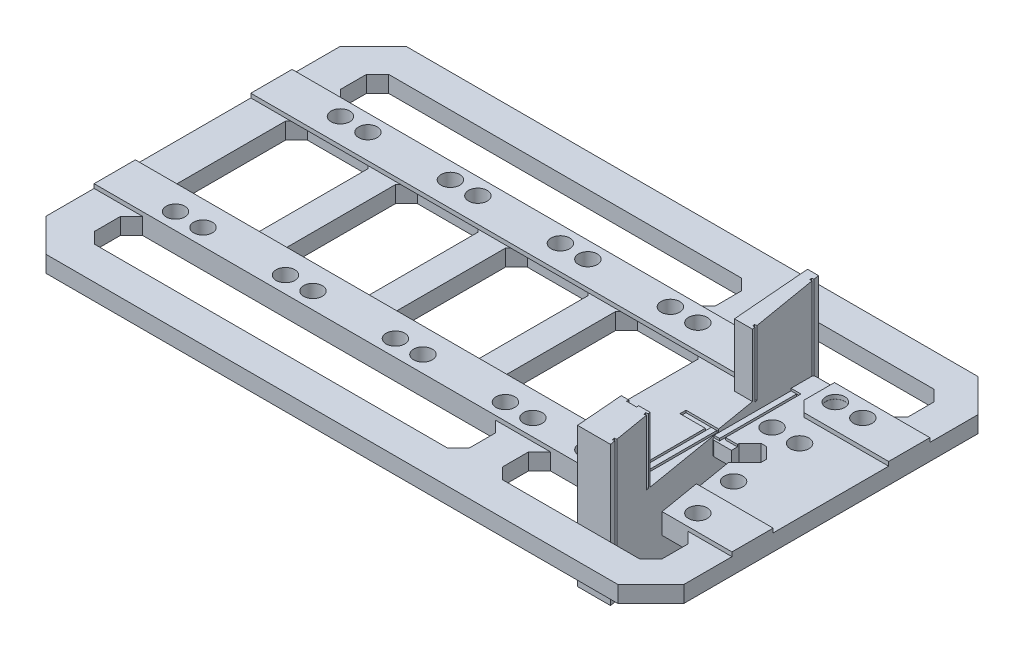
from build123d import *

# Parameters (mm, degrees)
SKETCH1_R           = 1.7
BOSS_EXTRUDE1_DEPTH = 3
SKETCH2_W           = 1
SKETCH2_H           = 14
CUT_EXTRUDE1_DEPTH  = 0.4
BOSS_EXTRUDE2_DEPTH = 11
BOSS_EXTRUDE3_DEPTH = 11.4
SKETCH9_W           = 0.4
SKETCH9_H           = 25.4
SKETCH9_H_2         = 12.2
CUT_EXTRUDE5_DEPTH  = 0.4
SKETCH10_W          = 1.8
SKETCH10_H          = 11.8
CUT_EXTRUDE6_DEPTH  = 0.4
SKETCH11_R          = 1.711275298
SKETCH11_R_2        = 1.7
BOSS_EXTRUDE4_DEPTH = 0.75


with BuildPart() as part:
    # Sketch1 → Boss-Extrude1 (new body)
    with BuildSketch(Plane(origin=(0, 0, 0), x_dir=(1, 0, 0), z_dir=(0, 1, 0))):
        Polygon((57, -32.75), (-47, -32.75), (-53, -26.75), (-53, 26.75), (-47, 32.75), (57, 32.75), (63, 26.75), (63, -26.75), align=None)
        with Locations(Location((51.3, -6, 0), (0, 0, 90))):
            Circle(SKETCH1_R, mode=Mode.SUBTRACT)
        with Locations(Location((51.3, 6, 0), (0, 0, 270))):
            Circle(SKETCH1_R, mode=Mode.SUBTRACT)
        with Locations(Location((33.8, -15, 0), (0, 0, 270))):
            Circle(SKETCH1_R, mode=Mode.SUBTRACT)
        with Locations(Location((46.3, 6, 0), (0, 0, 270))):
            Circle(SKETCH1_R, mode=Mode.SUBTRACT)
        with Locations(Location((23.8, 14.999999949, 0), (0, 0, 270))):
            Circle(SKETCH1_R, mode=Mode.SUBTRACT)
        with Locations(Location((18.8, 14.999999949, 0), (0, 0, 270))):
            Circle(SKETCH1_R, mode=Mode.SUBTRACT)
        with Locations(Location((3.8, 14.999999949, 0), (0, 0, 270))):
            Circle(SKETCH1_R, mode=Mode.SUBTRACT)
        with Locations(Location((-1.2, 14.999999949, 0), (0, 0, 270))):
            Circle(SKETCH1_R, mode=Mode.SUBTRACT)
        with Locations(Location((-16.2, 14.999999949, 0), (0, 0, 270))):
            Circle(SKETCH1_R, mode=Mode.SUBTRACT)
        with Locations(Location((-21.2, 14.999999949, 0), (0, 0, 270))):
            Circle(SKETCH1_R, mode=Mode.SUBTRACT)
        with Locations(Location((48.8, 15, 0), (0, 0, 270))):
            Circle(SKETCH1_R, mode=Mode.SUBTRACT)
        with Locations(Location((-36.2, 14.999999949, 0), (0, 0, 270))):
            Circle(SKETCH1_R, mode=Mode.SUBTRACT)
        with Locations(Location((-41.2, 14.999999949, 0), (0, 0, 270))):
            Circle(SKETCH1_R, mode=Mode.SUBTRACT)
        with Locations(Location((53.8, -15, 0), (0, 0, 90))):
            Circle(SKETCH1_R, mode=Mode.SUBTRACT)
        with Locations(Location((-41.2, -15, 0), (0, 0, 90))):
            Circle(SKETCH1_R, mode=Mode.SUBTRACT)
        with Locations(Location((-36.2, -15, 0), (0, 0, 90))):
            Circle(SKETCH1_R, mode=Mode.SUBTRACT)
        with Locations(Location((-21.2, -15, 0), (0, 0, 90))):
            Circle(SKETCH1_R, mode=Mode.SUBTRACT)
        with Locations(Location((53.8, 15, 0), (0, 0, 270))):
            Circle(SKETCH1_R, mode=Mode.SUBTRACT)
        with Locations(Location((-16.2, -15, 0), (0, 0, 90))):
            Circle(SKETCH1_R, mode=Mode.SUBTRACT)
        with Locations(Location((-1.2, -15, 0), (0, 0, 90))):
            Circle(SKETCH1_R, mode=Mode.SUBTRACT)
        with Locations(Location((3.8, -15, 0), (0, 0, 90))):
            Circle(SKETCH1_R, mode=Mode.SUBTRACT)
        with Locations(Location((18.8, -15, 0), (0, 0, 90))):
            Circle(SKETCH1_R, mode=Mode.SUBTRACT)
        with Locations(Location((23.8, -15, 0), (0, 0, 90))):
            Circle(SKETCH1_R, mode=Mode.SUBTRACT)
        with Locations(Location((33.8, 15, 0), (0, 0, 270))):
            Circle(SKETCH1_R, mode=Mode.SUBTRACT)
        Polygon((13.800005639, 9.999999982), (13.800005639, -10.000000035), (15.800005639, -12.000000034), (26.800005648, -12.000000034), (28.800005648, -10.000000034), (28.800005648, 9.999999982), (26.800005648, 11.999999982), (15.80000564, 11.999999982), align=None, mode=Mode.SUBTRACT)
        Polygon((-44.2, 17.999999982), (-46.2, 19.999999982), (-46.2, 24.75), (-44.2, 26.75), (20.000000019, 26.75), (22.000000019, 24.75), (22.000000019, 19.999999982), (20.000000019, 17.999999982), align=None, mode=Mode.SUBTRACT)
        with BuildLine():
            Line((42.25, 17.999999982), (55, 17.999999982))
            Line((55, 17.999999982), (57, 19.999999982))
            Line((57, 19.999999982), (57, 24.749999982))
            Line((57, 24.749999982), (55, 26.749999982))
            Line((55, 26.749999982), (30.000000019, 26.749999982))
            Line((30.000000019, 26.749999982), (28.000000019, 24.749999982))
            Line((28.000000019, 24.749999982), (28.000000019, 19.999999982))
            Line((28.000000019, 19.999999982), (30.000000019, 17.999999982))
            Line((30.000000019, 17.999999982), (34.383003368, 17.999999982))
            Line((34.383003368, 17.999999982), (36.222260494, 19.993529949))
            Line((36.222260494, 19.993529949), (36.000000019, 22.749999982))
            Line((36.000000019, 22.749999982), (38.000000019, 22.749999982))
            Line((38.000000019, 22.749999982), (45.668539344, -22.750000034))
            Line((45.668539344, -22.750000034), (39.66876894, -22.750000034))
            Line((39.66876894, -22.750000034), (39.446508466, -19.99353))
            Line((39.446508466, -19.99353), (37.285765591, -18.000000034))
            Line((37.285765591, -18.000000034), (30.000000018, -18.000000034))
            Line((30.000000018, -18.000000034), (28.000000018, -20.000000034))
            Line((28.000000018, -20.000000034), (28.000000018, -24.750000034))
            Line((28.000000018, -24.750000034), (30.000000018, -26.750000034))
            Line((30.000000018, -26.750000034), (55, -26.750000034))
            Line((55, -26.750000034), (57, -24.750000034))
            Line((57, -24.750000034), (57, -20.000000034))
            Line((57, -20.000000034), (55, -18.000000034))
            Line((55, -18.000000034), (50.296747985, -18.000000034))
            Line((50.296747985, -18.000000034), (47.845293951, -3.454706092))
            Line((47.845293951, -3.454706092), (50.8, -0.5))
            Line((50.8, -0.5), (50.8, 0.5))
            Line((50.8, 0.5), (48.8, 2.5))
            Line((48.8, 2.5), (47.8, 2.5))
            Line((47.8, 2.5), (45.8, 0.5))
            Line((45.8, 0.5), (45.8, -0.9))
            Line((45.8, -0.9), (42.65, -0.9))
            ThreePointArc((42.65, -0.9), (42.367157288, -0.782842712), (42.25, -0.5))
            Line((42.25, -0.5), (42.25, 9.5))
            ThreePointArc((42.25, 9.5), (41.967157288, 9.617157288), (41.85, 9.9))
            Line((41.85, 9.9), (41.85, 17.599999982))
            ThreePointArc((41.85, 17.599999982), (41.967157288, 17.882842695), (42.25, 17.999999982))
        make_face(mode=Mode.SUBTRACT)
        Polygon((22.000000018, -20.000000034), (22.000000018, -24.75), (20.000000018, -26.75), (-44.199999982, -26.75), (-46.199999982, -24.75), (-46.199999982, -20.000000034), (-44.199999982, -18.000000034), (20.000000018, -18.000000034), align=None, mode=Mode.SUBTRACT)
        Polygon((-6.199996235, 9.999999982), (-6.199996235, -10.000000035), (-4.199996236, -12.000000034), (6.800003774, -12.000000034), (8.800003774, -10.000000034), (8.800003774, 9.999999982), (6.800003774, 11.999999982), (-4.199996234, 11.999999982), align=None, mode=Mode.SUBTRACT)
        Polygon((-44.199999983, 11.999999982), (-46.199999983, 9.999999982), (-46.199999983, -10.000000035), (-44.199999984, -12.000000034), (-33.199999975, -12.000000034), (-31.199999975, -10.000000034), (-31.199999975, 9.999999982), (-33.199999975, 11.999999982), align=None, mode=Mode.SUBTRACT)
        Polygon((-26.199998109, 9.999999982), (-26.199998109, -10.000000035), (-24.19999811, -12.000000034), (-13.1999981, -12.000000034), (-11.1999981, -10.000000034), (-11.1999981, 9.999999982), (-13.1999981, 11.999999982), (-24.199998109, 11.999999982), align=None, mode=Mode.SUBTRACT)
    extrude(amount=BOSS_EXTRUDE1_DEPTH)

    # Sketch2 → Cut-Extrude1 (cut)
    with BuildSketch(Plane(origin=(0, 3, 0), x_dir=(1, 0, 0), z_dir=(0, 1, 0))):
        Polygon((43.65, 0.184270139), (48.25, 0.189312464), (48.25, -0.9), (44.225, -0.9), (44.225, -14.1), (40.35, -14.1), (40.35, -0.2), (35.75, -0.2), (35.75, 0.9), (41.8, 0.9), (41.8, 13.9), (43.65, 13.9), align=None)
        with Locations((41.25, -6.5)):
            Rectangle(SKETCH2_W, SKETCH2_H, mode=Mode.SUBTRACT)
        with Locations((42.75, 6.5)):
            Rectangle(SKETCH2_W, SKETCH2_H, mode=Mode.SUBTRACT)
    extrude(amount=-CUT_EXTRUDE1_DEPTH, mode=Mode.SUBTRACT)

    # Sketch5 → Boss-Extrude2 (add)
    with BuildSketch(Plane(origin=(0, 0, 0), x_dir=(1, 0, 0), z_dir=(0, 1, 0))):
        Polygon((45.668539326, -22.75), (38, 22.75), (36, 22.75), (39.668768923, -22.75), align=None)
    extrude(amount=-BOSS_EXTRUDE2_DEPTH)

    # Sketch7 → Boss-Extrude3 (add)
    with BuildSketch(Plane(origin=(0, 3, 0), x_dir=(1, 0, 0), z_dir=(0, 1, 0))):
        Polygon((38.000000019, 22.749999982), (40.435393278, 8.299999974), (37.165136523, 8.299999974), (36.000000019, 22.749999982), align=None)
        Polygon((45.668539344, -22.750000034), (39.66876894, -22.750000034), (38.971299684, -14.100000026), (44.210674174, -14.100000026), align=None)
    extrude(amount=BOSS_EXTRUDE3_DEPTH)

    # Sketch9 → Cut-Extrude5 (cut)
    with BuildSketch(Plane(origin=(40.678768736, 0, -6.855972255), x_dir=(-0.1661954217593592, 0, -0.9860928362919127), z_dir=(0.9860928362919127, 0, -0.1661954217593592))):
        with Locations((14.918185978, 1.7)):
            Rectangle(SKETCH9_W, SKETCH9_H)
        with Locations((-28.823514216, 1.7)):
            Rectangle(SKETCH9_W, SKETCH9_H)
        with Locations((-21.848699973, 8.7)):
            Rectangle(SKETCH9_W, SKETCH9_H_2)
        Polygon((2.464990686, 14.798503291), (2.064991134, 14.799101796), (2.046738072, 2.6), (2.44673852, 2.6), align=None)
    extrude(amount=-CUT_EXTRUDE5_DEPTH, mode=Mode.SUBTRACT)

    # Sketch10 → Cut-Extrude6 (cut)
    with BuildSketch(Plane(origin=(0, 0, 14.1), x_dir=(-1, 0, 0), z_dir=(0, 0, -1))):
        with Locations((-41.25, 8.5)):
            Rectangle(SKETCH10_W, SKETCH10_H)
    extrude(amount=-CUT_EXTRUDE6_DEPTH, mode=Mode.SUBTRACT)

    # Sketch11 → Boss-Extrude4 (add)
    # profile 1 of 4: a face of its own
    with BuildSketch(Plane(origin=(0, 3, 0), x_dir=(1, 0, 0), z_dir=(0, 1, 0))):
        Polygon((45.65, 18), (45.65, 12.5), (47.65, 10.5), (63, 10.5), (63, 18), align=None)
        with Locations(Location((48.8, 15, 0), (0, 0, 270))):
            Circle(SKETCH11_R, mode=Mode.SUBTRACT)
        with Locations(Location((53.8, 15, 0), (0, 0, 270))):
            Circle(SKETCH11_R_2, mode=Mode.SUBTRACT)
    # profile 2 of 4: a face of its own
    with BuildSketch(Plane(origin=(0, 3, 0), x_dir=(1, 0, 0), z_dir=(0, 1, 0))):
        Polygon((34.383003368, 17.999999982), (36.222260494, 19.993529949), (36.987745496, 10.5), (-53, 10.5), (-53, 17.999999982), align=None)
        with Locations(Location((-41.2, 14.999999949, 0), (0, 0, 270))):
            Circle(SKETCH11_R_2, mode=Mode.SUBTRACT)
        with Locations(Location((-36.2, 15, 0), (0, 0, 270))):
            Circle(SKETCH11_R_2, mode=Mode.SUBTRACT)
        with Locations(Location((-21.2, 15, 0), (0, 0, 270))):
            Circle(SKETCH11_R_2, mode=Mode.SUBTRACT)
        with Locations(Location((-16.2, 15, 0), (0, 0, 270))):
            Circle(SKETCH11_R_2, mode=Mode.SUBTRACT)
        with Locations(Location((-1.2, 15, 0), (0, 0, 270))):
            Circle(SKETCH11_R_2, mode=Mode.SUBTRACT)
        with Locations(Location((3.8, 15, 0), (0, 0, 270))):
            Circle(SKETCH11_R_2, mode=Mode.SUBTRACT)
        with Locations(Location((18.8, 15, 0), (0, 0, 270))):
            Circle(SKETCH11_R_2, mode=Mode.SUBTRACT)
        with Locations(Location((23.8, 15, 0), (0, 0, 270))):
            Circle(SKETCH11_R_2, mode=Mode.SUBTRACT)
        with Locations(Location((33.8, 15, 0), (0, 0, 270))):
            Circle(SKETCH11_R_2, mode=Mode.SUBTRACT)
    # profile 3 of 4: a face of its own
    with BuildSketch(Plane(origin=(0, 3, 0), x_dir=(1, 0, 0), z_dir=(0, 1, 0))):
        Polygon((-53, -18), (37.285765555, -18), (39.446508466, -19.993530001), (38.971299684, -14.100000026), (35.371299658, -10.5), (-53, -10.5), align=None)
        with Locations(Location((-41.2, -15, 0), (0, 0, 90))):
            Circle(SKETCH11_R_2, mode=Mode.SUBTRACT)
        with Locations(Location((-36.2, -15, 0), (0, 0, 90))):
            Circle(SKETCH11_R_2, mode=Mode.SUBTRACT)
        with Locations(Location((-21.2, -15, 0), (0, 0, 90))):
            Circle(SKETCH11_R_2, mode=Mode.SUBTRACT)
        with Locations(Location((-16.2, -15, 0), (0, 0, 90))):
            Circle(SKETCH11_R_2, mode=Mode.SUBTRACT)
        with Locations(Location((-1.2, -15, 0), (0, 0, 90))):
            Circle(SKETCH11_R_2, mode=Mode.SUBTRACT)
        with Locations(Location((3.8, -15, 0), (0, 0, 90))):
            Circle(SKETCH11_R_2, mode=Mode.SUBTRACT)
        with Locations(Location((18.8, -15, 0), (0, 0, 90))):
            Circle(SKETCH11_R_2, mode=Mode.SUBTRACT)
        with Locations(Location((23.8, -15, 0), (0, 0, 90))):
            Circle(SKETCH11_R_2, mode=Mode.SUBTRACT)
        with Locations(Location((33.8, -15, 0), (0, 0, 270))):
            Circle(SKETCH11_R_2, mode=Mode.SUBTRACT)
    # profile 4 of 4: a face of its own
    with BuildSketch(Plane(origin=(0, 3, 0), x_dir=(1, 0, 0), z_dir=(0, 1, 0))):
        Polygon((63, -18), (63, -10.5), (49.032703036, -10.5), (50.296747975, -18), align=None)
        with Locations(Location((53.8, -15, 0), (0, 0, 90.000000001))):
            Circle(SKETCH11_R_2, mode=Mode.SUBTRACT)
    extrude(amount=BOSS_EXTRUDE4_DEPTH)


solid = part.part
